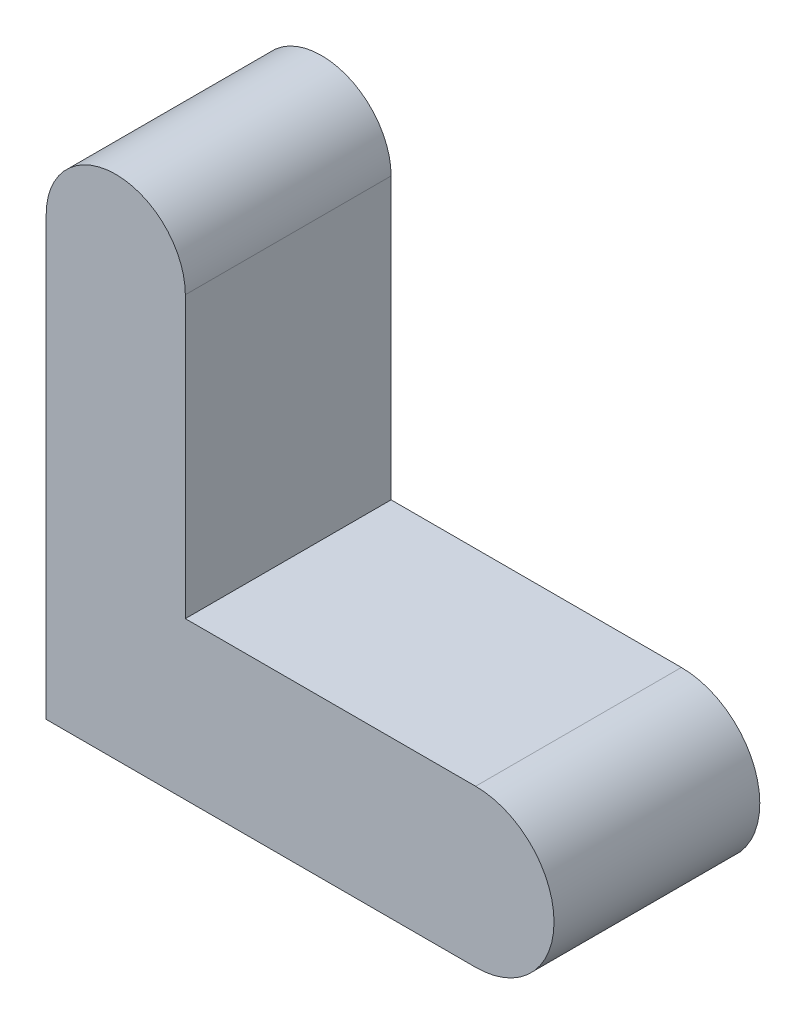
from build123d import *

# Parameters (mm, degrees)
EXTRUDE1_START = 30
EXTRUDE1_DEPTH = 51


with BuildPart() as part:
    # Sketch1 → Extrude1 (new body)
    with BuildSketch(Plane.XY.offset(EXTRUDE1_START)):
        with BuildLine():
            Line((-61.303638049, -19.434884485), (45.12628912, -19.434884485))
            ThreePointArc((45.12628912, -19.434884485), (64.561173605, 0), (45.12628912, 19.434884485))
            Line((45.12628912, 19.434884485), (-26.820341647, 19.434884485))
            Line((-26.820341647, 19.434884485), (-26.820341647, 88.954375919))
            ThreePointArc((-26.820341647, 88.954375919), (-44.061989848, 106.196024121), (-61.303638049, 88.954375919))
            Line((-61.303638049, 88.954375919), (-61.303638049, -19.434884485))
        make_face()
    extrude(amount=EXTRUDE1_DEPTH)


solid = part.part
